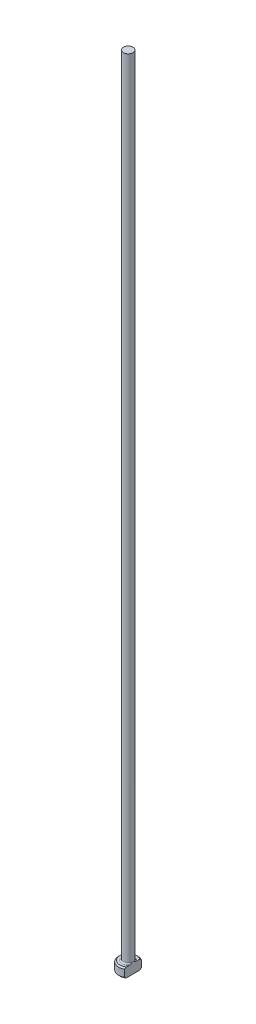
from build123d import *
from build123d.topology import SkipClean

# Parameters (mm, degrees)
CHAMFER1_SIZE = 0.2
FILLET1_R     = 0.2
KEY_DEPTH     = 126.017998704


with BuildPart() as part:
    # Sketch1 → Revolve1 (revolve)
    with BuildSketch(Plane.XY, mode=Mode.PRIVATE) as revolve1_sk:
        Polygon((0, 0), (-1.5, 0), (-1.5, 1.5), (-0.75, 1.5), (-0.75, 125), (0, 125), align=None)
    revolve(revolve1_sk.sketch.rotate(Axis((0, 259.958771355, 0), (0, -1, 0)), 270), axis=Axis((0, 259.958771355, 0), (0, -1, 0)))

    # Chamfer1
    chamfer1_edges = [part.edges().sort_by_distance(p)[0] for p in [
        (0, 1.5, -1.5),
        (0, 0, -1.5),
    ]]
    chamfer(chamfer1_edges, length=CHAMFER1_SIZE)

    # Fillet1
    fillet1_edges = [part.edges().sort_by_distance(p)[0] for p in [
        (0, 1.5, -0.75),
    ]]
    fillet(fillet1_edges, radius=FILLET1_R)

    # Sketch2 → KEY (cut, through all)
    with SkipClean():  # the faces are left unmerged after this step: merging them gives an invalid solid
        with BuildSketch(Plane(origin=(0, 0, 0), x_dir=(1, 0, 0), z_dir=(0, 1, 0))):
            with BuildLine():
                Line((0.75, 1.299038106), (0.75, -1.299038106))
                ThreePointArc((0.75, -1.299038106), (1.5, 0), (0.75, 1.299038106))
            make_face()
        extrude(amount=KEY_DEPTH, mode=Mode.SUBTRACT)


solid = part.part
